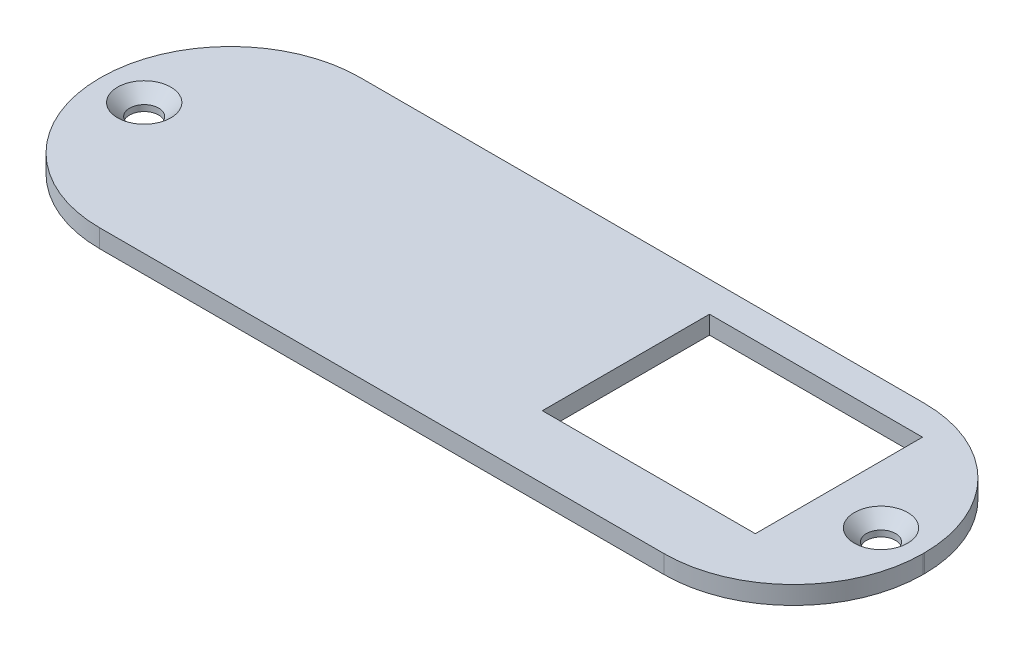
from build123d import *

# Parameters (mm, degrees)
BOSS_EXTRUDE1_DEPTH                            = 1.5
CSK_FOR_M2_FLAT_HEAD_MACHINE_SCREW1_AT_2_COUNT = 2
CSK_FOR_M2_FLAT_HEAD_MACHINE_SCREW1_AT_2_PITCH = 60.845537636
SKETCH5_W                                      = 17.590141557
SKETCH5_H                                      = 13.805276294
CUT_EXTRUDE1_DEPTH                             = 1.5


with BuildPart() as part:
    # Sketch1 → Boss-Extrude1 (new body)
    with BuildSketch(Plane(origin=(0, 0, 0), x_dir=(1, 0, 0), z_dir=(0, 1, 0))):
        with BuildLine():
            Line((10.7, 0), (57.3, 0))
            ThreePointArc((57.3, 0), (64.866042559, 3.133957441), (68, 10.7))
            Line((68, 10.7), (68, 10.8))
            ThreePointArc((68, 10.8), (64.866042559, 18.366042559), (57.3, 21.5))
            Line((57.3, 21.5), (10.7, 21.5))
            ThreePointArc((10.7, 21.5), (3.133957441, 18.366042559), (0, 10.8))
            Line((0, 10.8), (0, 10.7))
            ThreePointArc((0, 10.7), (3.133957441, 3.133957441), (10.7, 0))
        make_face()
    extrude(amount=BOSS_EXTRUDE1_DEPTH)

    # Sketch4 → CSK for M2 Flat Head Machine Screw1 (revolve, cut)
    with BuildSketch(Plane(origin=(3.578036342, 1.5, -10.8), x_dir=(0, 0, 1), z_dir=(1, 0, 0))):
        Polygon((0, 0), (0, 1.5), (1.2, 1.5), (1.2, 1), (2.2, 0), align=None)
    csk_for_m2_flat_head_machine_screw1 = revolve(axis=Axis((3.578036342, 7.85, -10.8), (0, -1, 0)), mode=Mode.SUBTRACT)

    # CSK for M2 Flat Head Machine Screw1 at 2: CSK for M2 Flat Head Machine Screw1 ×2
    with Locations(*[(i * CSK_FOR_M2_FLAT_HEAD_MACHINE_SCREW1_AT_2_PITCH, 0, 0) for i in range(1, CSK_FOR_M2_FLAT_HEAD_MACHINE_SCREW1_AT_2_COUNT)]):
        add(csk_for_m2_flat_head_machine_screw1, mode=Mode.SUBTRACT)

    # Sketch5 → Cut-Extrude1 (cut)
    with BuildSketch(Plane(origin=(0, 1.5, 0), x_dir=(1, 0, 0), z_dir=(0, 1, 0))):
        with Locations((50.854929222, 12.097361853)):
            Rectangle(SKETCH5_W, SKETCH5_H)
    extrude(amount=-CUT_EXTRUDE1_DEPTH, mode=Mode.SUBTRACT)


solid = part.part
